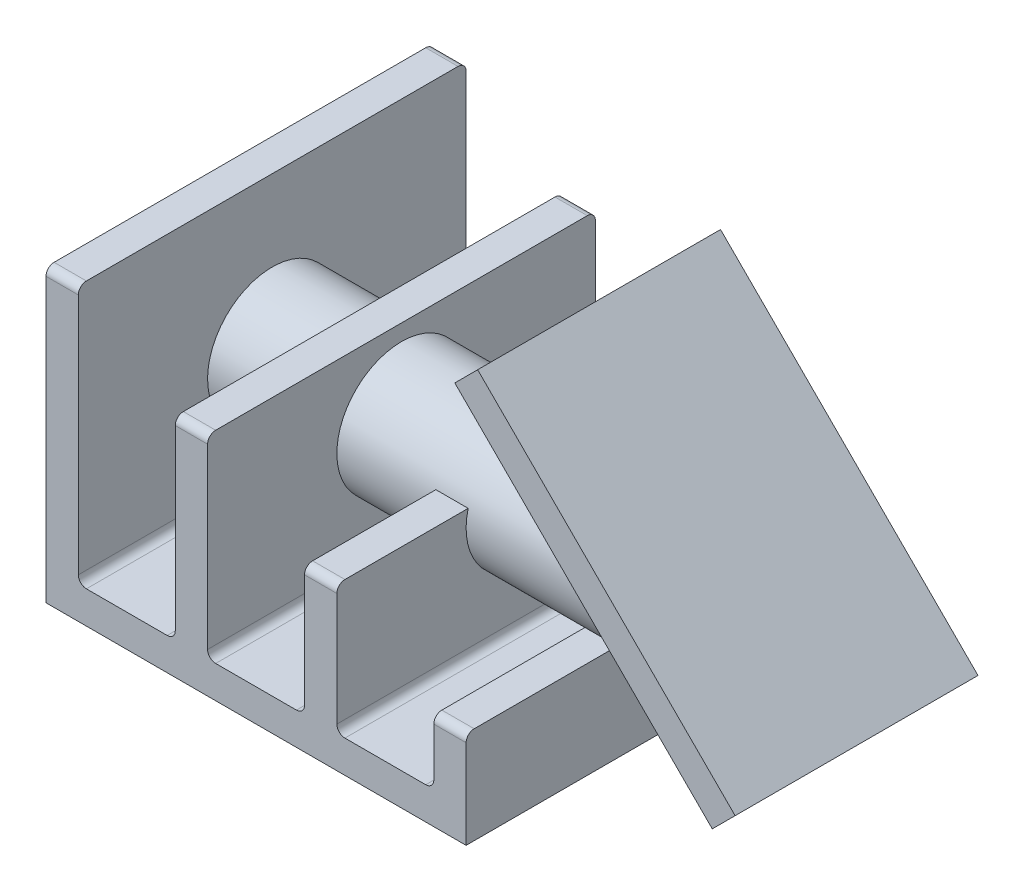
from build123d import *

# Parameters (mm, degrees)
EXTRUDE1_DEPTH = 152.4
SKETCH2_R      = 25.4
EXTRUDE2_DEPTH = 152.4
FILLET1_R      = 3.175
SKETCH3_W      = 95.44339602
SKETCH3_H      = 143.095843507
EXTRUDE3_DEPTH = 12.7


with BuildPart() as part:
    # Sketch1 → Extrude1 (new body)
    with BuildSketch(Plane.XY):
        Polygon((0, 0), (0, 114.3), (12.7, 114.3), (12.7, 12.7), (50.8, 12.7), (50.8, 88.9), (63.5, 88.9), (63.5, 12.7), (101.6, 12.7), (101.6, 63.5), (114.3, 63.5), (114.3, 12.7), (152.4, 12.7), (152.4, 38.1), (165.1, 38.1), (165.1, 0), align=None)
    extrude(amount=-EXTRUDE1_DEPTH)

    # Sketch2 → Extrude2 (add)
    with BuildSketch(Plane(origin=(12.7, 0, 0), x_dir=(0, 0, -1), z_dir=(1, 0, 0))):
        with Locations(Location((76.2, 57.15, 0), (0, 0, 311.409622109))):
            Circle(SKETCH2_R)
    extrude(amount=EXTRUDE2_DEPTH)

    # Fillet1
    fillet1_edges = [part.edges().sort_by_distance(p)[0] for p in [
        (158.75, 38.1, -152.4),
        (6.35, 114.3, 0),
        (57.15, 88.9, 0),
        (107.95, 63.5, 0),
        (158.75, 38.1, 0),
        (107.95, 63.5, -152.4),
        (12.7, 12.7, -76.2),
        (50.8, 12.7, -76.2),
        (63.5, 12.7, -76.2),
        (101.6, 12.7, -76.2),
        (114.3, 12.7, -76.2),
        (152.4, 12.7, -76.2),
        (57.15, 88.9, -152.4),
        (6.35, 114.3, -152.4),
    ]]
    fillet(fillet1_edges, radius=FILLET1_R)


with BuildPart() as body_2:
    # Sketch3 → Extrude3 (new body)
    with BuildSketch(Plane(origin=(128.540768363, 128.540768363, 0), x_dir=(0, 0, -1), z_dir=(0.7071067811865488, 0.7071067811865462, 0))):
        with Locations((77.091994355, -75.433433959)):
            Rectangle(SKETCH3_W, SKETCH3_H)
    extrude(amount=EXTRUDE3_DEPTH)


solid = Compound([part.part, body_2.part])
